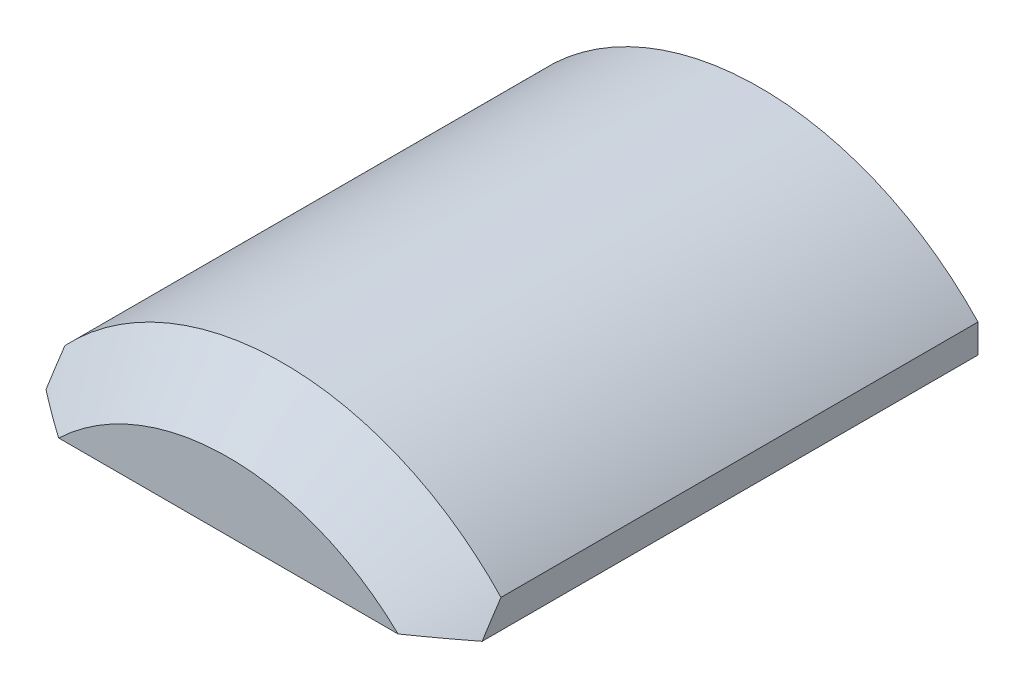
from build123d import *

# Parameters (mm, degrees)
BOSS_EXTRUDE1_DEPTH = 247.65
CHAMFER1_SIZE       = 25.4


with BuildPart() as part:
    # Sketch1 → Boss-Extrude1 (new body)
    with BuildSketch(Plane.XY):
        with BuildLine():
            Line((101.6, 95.882897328), (101.6, 82.55))
            Line((101.6, 82.55), (-101.6, 82.55))
            Line((-101.6, 82.55), (-101.6, 95.882897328))
            ThreePointArc((-101.6, 95.882897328), (0, 139.7), (101.6, 95.882897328))
        make_face()
    extrude(amount=BOSS_EXTRUDE1_DEPTH)

    # Chamfer1
    chamfer1_edges = [part.edges().sort_by_distance(p)[0] for p in [
        (0, 139.7, 247.65),
    ]]
    chamfer(chamfer1_edges, length=CHAMFER1_SIZE)


solid = part.part
